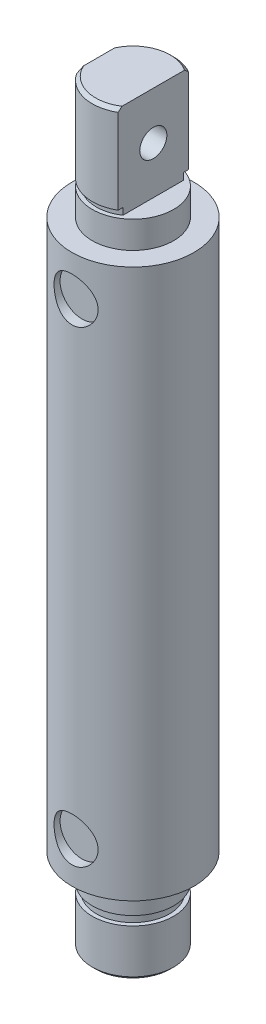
from build123d import *
from build123d.topology import SkipClean

# Parameters (mm, degrees)
SKETCH1_R          = 14.2875
CYLINDERBODY_DEPTH = 128.5875
SKETCH2_R          = 9.525
BOSS1_DEPTH        = 6.35
BOSS2_START        = 6.35
SKETCH3_R          = 9.525
BOSS2_DEPTH        = 6.35
THRD_TANG_DEPTH    = 22.225
SKETCH5_W          = 0.9652
SKETCH5_H          = 1.5875
THRD_RELIEF_START  = 2.1082
SKETCH6_R          = 8.5598
THRD_RELIEF_DEPTH  = 2.1082
ROD_BOSS_START     = 11.1125
SKETCH7_R          = 9.525
ROD_BOSS_DEPTH     = 11.1125
CHAMFER1_SIZE      = 0.7874
SKETCH8_R          = 3.175
F_1_4HOLE_DEPTH    = 160.367922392
SKETCH9_R          = 5.15874
PORT_DEPTH         = 2.3622


with BuildPart() as part:
    # Sketch1 → CylinderBody (new body)
    with BuildSketch(Plane(origin=(0, 0, 0), x_dir=(1, 0, 0), z_dir=(0, 1, 0))):
        with Locations(Location((0, 0, 0), (0, 0, 270))):
            Circle(SKETCH1_R)
    extrude(amount=CYLINDERBODY_DEPTH)

    # Sketch2 → Boss1 (add)
    with BuildSketch(Plane(origin=(0, 128.5875, 0), x_dir=(-1, 0, 0), z_dir=(0, 1, 0))):
        with Locations(Location((0, 0, 0), (0, 0, 270))):
            Circle(SKETCH2_R)
    extrude(amount=BOSS1_DEPTH)

    # Sketch3 → Boss2 (add)
    with BuildSketch(Plane.XZ.offset(BOSS2_START)):
        with Locations(Location((0, 0, 0), (0, 0, 270))):
            Circle(SKETCH3_R)
    extrude(amount=-BOSS2_DEPTH)

    # Sketch4 → Thrd.Tang (add)
    with SkipClean():  # the faces are left unmerged after this step: merging them gives an invalid solid
        with BuildSketch(Plane(origin=(0, 134.9375, 0), x_dir=(-1, 0, 0), z_dir=(0, 1, 0))):
            with BuildLine():
                Line((-4.7625, -8.248891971), (-4.7625, 8.248891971))
                ThreePointArc((-4.7625, 8.248891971), (2.178496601, 9.272528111), (7.9375, 5.265141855))
                Line((7.9375, 5.265141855), (7.9375, -5.265141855))
                ThreePointArc((7.9375, -5.265141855), (2.178496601, -9.272528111), (-4.7625, -8.248891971))
            make_face()
        extrude(amount=THRD_TANG_DEPTH)

    # Sketch5 → Cut-Revolve1 (revolve, cut)
    with BuildSketch(Plane(origin=(0, 0, 0), x_dir=(0, 0, -1), z_dir=(1, 0, 0)), mode=Mode.PRIVATE) as cut_revolve1_sk:
        with Locations((9.0424, 135.73125)):
            Rectangle(SKETCH5_W, SKETCH5_H)
    revolve(cut_revolve1_sk.sketch.rotate(Axis((0, 0, 0), (0, 1, 0)), 180), axis=Axis((0, 0, 0), (0, 1, 0)), mode=Mode.SUBTRACT)

    # Sketch6 → thrd-relief (add)
    with BuildSketch(Plane.XZ.offset(6.35).offset(THRD_RELIEF_START)):
        with Locations(Location((0, 0, 0), (0, 0, 270))):
            Circle(SKETCH6_R)
    extrude(amount=-THRD_RELIEF_DEPTH)

    # Sketch7 → Rod-Boss (add)
    with BuildSketch(Plane.XZ.offset(8.4582).offset(ROD_BOSS_START)):
        with Locations(Location((0, 0, 0), (0, 0, 270))):
            Circle(SKETCH7_R)
    extrude(amount=-ROD_BOSS_DEPTH)

    # Chamfer1
    chamfer1_edges = [part.edges().sort_by_distance(p)[0] for p in [
        (-2.178496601, 157.1625, -9.272528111),
        (-2.178496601, 157.1625, 9.272528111),
        (0, -19.5707, 9.525),
    ]]
    chamfer(chamfer1_edges, length=CHAMFER1_SIZE)

    # Sketch8 → 1_4Hole (cut, through all)
    with BuildSketch(Plane.ZY.offset(7.9375)):
        with Locations((0, 146.05)):
            Circle(SKETCH8_R)
    extrude(amount=-F_1_4HOLE_DEPTH, mode=Mode.SUBTRACT)

    # Sketch9 → Port (cut)
    with BuildSketch(Plane.XY.offset(14.2875)):
        with Locations((0, 9.525)):
            Circle(SKETCH9_R)
        with Locations((0, 119.0625)):
            Circle(SKETCH9_R)
    extrude(amount=-PORT_DEPTH, mode=Mode.SUBTRACT)


solid = part.part
